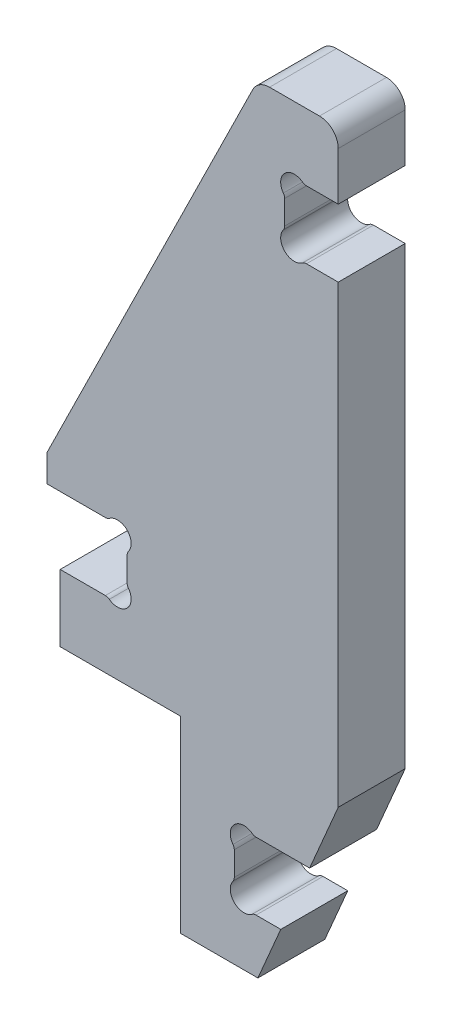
ISO-10303-21;
HEADER;
FILE_DESCRIPTION(('STEP AP214'),'2;1');
FILE_NAME('part.step','',(''),(''),'','','');
FILE_SCHEMA(('AUTOMOTIVE_DESIGN { 1 0 10303 214 1 1 1 1 }'));
ENDSEC;
DATA;
#1=APPLICATION_CONTEXT('core data for automotive mechanical design processes');
#2=APPLICATION_PROTOCOL_DEFINITION('international standard','automotive_design',2000,#1);
#3=PRODUCT_CONTEXT('',#1,'mechanical');
#4=PRODUCT('Part','Part','',(#3));
#5=PRODUCT_RELATED_PRODUCT_CATEGORY('part','',(#4));
#6=PRODUCT_DEFINITION_FORMATION('','',#4);
#7=PRODUCT_DEFINITION_CONTEXT('part definition',#1,'design');
#8=PRODUCT_DEFINITION('design','',#6,#7);
#9=PRODUCT_DEFINITION_SHAPE('','',#8);
#10=(LENGTH_UNIT() NAMED_UNIT(*) SI_UNIT(.MILLI.,.METRE.));
#11=(NAMED_UNIT(*) PLANE_ANGLE_UNIT() SI_UNIT($,.RADIAN.));
#12=(NAMED_UNIT(*) SI_UNIT($,.STERADIAN.) SOLID_ANGLE_UNIT());
#13=UNCERTAINTY_MEASURE_WITH_UNIT(LENGTH_MEASURE(1.E-05),#10,'distance_accuracy_value','');
#14=(GEOMETRIC_REPRESENTATION_CONTEXT(3) GLOBAL_UNCERTAINTY_ASSIGNED_CONTEXT((#13)) GLOBAL_UNIT_ASSIGNED_CONTEXT((#10,
#11,#12)) REPRESENTATION_CONTEXT('',''));
#15=CARTESIAN_POINT('',(0.,0.,0.));
#16=DIRECTION('',(0.,0.,1.));
#17=DIRECTION('',(1.,0.,0.));
#18=AXIS2_PLACEMENT_3D('',#15,#16,#17);
#19=CARTESIAN_POINT('',(46.9458414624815,267.7,25.));
#20=DIRECTION('',(0.,0.,-1.));
#21=DIRECTION('',(-1.,0.,0.));
#22=AXIS2_PLACEMENT_3D('',#19,#20,#21);
#23=CYLINDRICAL_SURFACE('',#22,2.50000000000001);
#24=CARTESIAN_POINT('',(46.9458414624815,267.7,0.));
#25=DIRECTION('',(0.,0.,1.));
#26=DIRECTION('',(1.,0.,0.));
#27=AXIS2_PLACEMENT_3D('',#24,#25,#26);
#28=CIRCLE('',#27,2.50000000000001);
#29=CARTESIAN_POINT('',(45.4574217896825,265.691366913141,0.));
#30=VERTEX_POINT('',#29);
#31=CARTESIAN_POINT('',(46.9458414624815,265.2,0.));
#32=VERTEX_POINT('',#31);
#33=EDGE_CURVE('E314',#30,#32,#28,.T.);
#34=ORIENTED_EDGE('',*,*,#33,.T.);
#35=DIRECTION('',(0.,0.,-1.));
#36=VECTOR('',#35,1.);
#37=CARTESIAN_POINT('',(46.9458414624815,265.2,25.));
#38=LINE('',#37,#36);
#39=CARTESIAN_POINT('',(46.9458414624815,265.2,25.));
#40=VERTEX_POINT('',#39);
#41=EDGE_CURVE('E297',#40,#32,#38,.T.);
#42=ORIENTED_EDGE('',*,*,#41,.F.);
#43=CARTESIAN_POINT('',(46.9458414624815,267.7,25.));
#44=DIRECTION('',(0.,0.,1.));
#45=DIRECTION('',(1.,0.,0.));
#46=AXIS2_PLACEMENT_3D('',#43,#44,#45);
#47=CIRCLE('',#46,2.50000000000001);
#48=CARTESIAN_POINT('',(45.4574217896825,265.691366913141,25.));
#49=VERTEX_POINT('',#48);
#50=EDGE_CURVE('E302',#49,#40,#47,.T.);
#51=ORIENTED_EDGE('',*,*,#50,.F.);
#52=DIRECTION('',(0.,0.,-1.));
#53=VECTOR('',#52,1.);
#54=CARTESIAN_POINT('',(45.4574217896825,265.691366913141,25.));
#55=LINE('',#54,#53);
#56=EDGE_CURVE('E422',#49,#30,#55,.T.);
#57=ORIENTED_EDGE('',*,*,#56,.T.);
#58=EDGE_LOOP('',(#34,#42,#51,#57));
#59=FACE_BOUND('',#58,.T.);
#60=ADVANCED_FACE('F33',(#59),#23,.T.);
#61=CARTESIAN_POINT('',(58.8148010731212,265.2,25.));
#62=DIRECTION('',(0.,1.,0.));
#63=DIRECTION('',(0.,0.,1.));
#64=AXIS2_PLACEMENT_3D('',#61,#62,#63);
#65=PLANE('',#64);
#66=DIRECTION('',(1.,0.,0.));
#67=VECTOR('',#66,1.);
#68=CARTESIAN_POINT('',(58.8148010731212,265.2,0.));
#69=LINE('',#68,#67);
#70=CARTESIAN_POINT('',(58.8148010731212,265.2,0.));
#71=VERTEX_POINT('',#70);
#72=EDGE_CURVE('E349',#32,#71,#69,.T.);
#73=ORIENTED_EDGE('',*,*,#72,.T.);
#74=DIRECTION('',(0.,0.,-1.));
#75=VECTOR('',#74,1.);
#76=CARTESIAN_POINT('',(58.8148010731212,265.2,25.));
#77=LINE('',#76,#75);
#78=CARTESIAN_POINT('',(58.8148010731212,265.2,25.));
#79=VERTEX_POINT('',#78);
#80=EDGE_CURVE('E300',#79,#71,#77,.T.);
#81=ORIENTED_EDGE('',*,*,#80,.F.);
#82=DIRECTION('',(1.,0.,0.));
#83=VECTOR('',#82,1.);
#84=CARTESIAN_POINT('',(58.8148010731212,265.2,25.));
#85=LINE('',#84,#83);
#86=EDGE_CURVE('E293',#40,#79,#85,.T.);
#87=ORIENTED_EDGE('',*,*,#86,.F.);
#88=ORIENTED_EDGE('',*,*,#41,.T.);
#89=EDGE_LOOP('',(#73,#81,#87,#88));
#90=FACE_BOUND('',#89,.T.);
#91=ADVANCED_FACE('F295',(#90),#65,.F.);
#92=CARTESIAN_POINT('',(58.8148010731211,290.2,25.));
#93=DIRECTION('',(-1.,0.,0.));
#94=DIRECTION('',(0.,-1.,0.));
#95=AXIS2_PLACEMENT_3D('',#92,#93,#94);
#96=PLANE('',#95);
#97=DIRECTION('',(0.,1.,0.));
#98=VECTOR('',#97,1.);
#99=CARTESIAN_POINT('',(58.8148010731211,290.2,0.));
#100=LINE('',#99,#98);
#101=CARTESIAN_POINT('',(58.8148010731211,283.2,0.));
#102=VERTEX_POINT('',#101);
#103=EDGE_CURVE('E346',#71,#102,#100,.T.);
#104=ORIENTED_EDGE('',*,*,#103,.T.);
#105=DIRECTION('',(0.,0.,-1.));
#106=VECTOR('',#105,1.);
#107=CARTESIAN_POINT('',(58.8148010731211,283.2,25.));
#108=LINE('',#107,#106);
#109=CARTESIAN_POINT('',(58.8148010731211,283.2,25.));
#110=VERTEX_POINT('',#109);
#111=EDGE_CURVE('E56',#102,#110,#108,.F.);
#112=ORIENTED_EDGE('',*,*,#111,.T.);
#113=DIRECTION('',(0.,1.,0.));
#114=VECTOR('',#113,1.);
#115=CARTESIAN_POINT('',(58.8148010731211,290.2,25.));
#116=LINE('',#115,#114);
#117=EDGE_CURVE('E301',#79,#110,#116,.T.);
#118=ORIENTED_EDGE('',*,*,#117,.F.);
#119=ORIENTED_EDGE('',*,*,#80,.T.);
#120=EDGE_LOOP('',(#104,#112,#118,#119));
#121=FACE_BOUND('',#120,.T.);
#122=ADVANCED_FACE('F348',(#121),#96,.F.);
#123=CARTESIAN_POINT('',(28.8148010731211,290.2,25.));
#124=DIRECTION('',(0.,-1.,0.));
#125=DIRECTION('',(1.,0.,0.));
#126=AXIS2_PLACEMENT_3D('',#123,#124,#125);
#127=PLANE('',#126);
#128=DIRECTION('',(-1.,0.,0.));
#129=VECTOR('',#128,1.);
#130=CARTESIAN_POINT('',(28.8148010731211,290.2,25.));
#131=LINE('',#130,#129);
#132=CARTESIAN_POINT('',(51.8148010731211,290.2,25.));
#133=VERTEX_POINT('',#132);
#134=CARTESIAN_POINT('',(33.1674325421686,290.2,25.));
#135=VERTEX_POINT('',#134);
#136=EDGE_CURVE('E332',#133,#135,#131,.T.);
#137=ORIENTED_EDGE('',*,*,#136,.F.);
#138=DIRECTION('',(0.,0.,-1.));
#139=VECTOR('',#138,1.);
#140=CARTESIAN_POINT('',(51.8148010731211,290.2,25.));
#141=LINE('',#140,#139);
#142=CARTESIAN_POINT('',(51.8148010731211,290.2,0.));
#143=VERTEX_POINT('',#142);
#144=EDGE_CURVE('E317',#133,#143,#141,.T.);
#145=ORIENTED_EDGE('',*,*,#144,.T.);
#146=DIRECTION('',(-1.,0.,0.));
#147=VECTOR('',#146,1.);
#148=CARTESIAN_POINT('',(28.8148010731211,290.2,0.));
#149=LINE('',#148,#147);
#150=CARTESIAN_POINT('',(33.1674325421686,290.2,0.));
#151=VERTEX_POINT('',#150);
#152=EDGE_CURVE('E347',#143,#151,#149,.T.);
#153=ORIENTED_EDGE('',*,*,#152,.T.);
#154=DIRECTION('',(0.,0.,-1.));
#155=VECTOR('',#154,1.);
#156=CARTESIAN_POINT('',(33.1674325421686,290.2,25.));
#157=LINE('',#156,#155);
#158=EDGE_CURVE('E315',#151,#135,#157,.F.);
#159=ORIENTED_EDGE('',*,*,#158,.T.);
#160=EDGE_LOOP('',(#137,#145,#153,#159));
#161=FACE_BOUND('',#160,.T.);
#162=ADVANCED_FACE('F336',(#161),#127,.F.);
#163=CARTESIAN_POINT('',(-50.,130.4,25.));
#164=DIRECTION('',(0.896850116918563,-0.442334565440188,0.));
#165=DIRECTION('',(0.442334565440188,0.896850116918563,0.));
#166=AXIS2_PLACEMENT_3D('',#163,#164,#165);
#167=PLANE('',#166);
#168=DIRECTION('',(-0.442334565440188,-0.896850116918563,0.));
#169=VECTOR('',#168,1.);
#170=CARTESIAN_POINT('',(-50.,130.4,25.));
#171=LINE('',#170,#169);
#172=CARTESIAN_POINT('',(26.8894817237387,286.296341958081,25.));
#173=VERTEX_POINT('',#172);
#174=CARTESIAN_POINT('',(-50.,130.4,25.));
#175=VERTEX_POINT('',#174);
#176=EDGE_CURVE('E340',#173,#175,#171,.T.);
#177=ORIENTED_EDGE('',*,*,#176,.F.);
#178=DIRECTION('',(0.,0.,-1.));
#179=VECTOR('',#178,1.);
#180=CARTESIAN_POINT('',(26.8894817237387,286.296341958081,25.));
#181=LINE('',#180,#179);
#182=CARTESIAN_POINT('',(26.8894817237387,286.296341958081,0.));
#183=VERTEX_POINT('',#182);
#184=EDGE_CURVE('E11',#173,#183,#181,.T.);
#185=ORIENTED_EDGE('',*,*,#184,.T.);
#186=DIRECTION('',(-0.442334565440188,-0.896850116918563,0.));
#187=VECTOR('',#186,1.);
#188=CARTESIAN_POINT('',(-50.,130.4,0.));
#189=LINE('',#188,#187);
#190=CARTESIAN_POINT('',(-50.,130.4,0.));
#191=VERTEX_POINT('',#190);
#192=EDGE_CURVE('E351',#183,#191,#189,.T.);
#193=ORIENTED_EDGE('',*,*,#192,.T.);
#194=DIRECTION('',(0.,0.,-1.));
#195=VECTOR('',#194,1.);
#196=CARTESIAN_POINT('',(-50.,130.4,25.));
#197=LINE('',#196,#195);
#198=EDGE_CURVE('E319',#175,#191,#197,.T.);
#199=ORIENTED_EDGE('',*,*,#198,.F.);
#200=EDGE_LOOP('',(#177,#185,#193,#199));
#201=FACE_BOUND('',#200,.T.);
#202=ADVANCED_FACE('F956',(#201),#167,.F.);
#203=CARTESIAN_POINT('',(-50.,120.4,25.));
#204=DIRECTION('',(1.,0.,0.));
#205=DIRECTION('',(0.,1.,0.));
#206=AXIS2_PLACEMENT_3D('',#203,#204,#205);
#207=PLANE('',#206);
#208=DIRECTION('',(0.,-1.,0.));
#209=VECTOR('',#208,1.);
#210=CARTESIAN_POINT('',(-50.,120.4,0.));
#211=LINE('',#210,#209);
#212=CARTESIAN_POINT('',(-50.,120.4,0.));
#213=VERTEX_POINT('',#212);
#214=EDGE_CURVE('E357',#191,#213,#211,.T.);
#215=ORIENTED_EDGE('',*,*,#214,.T.);
#216=DIRECTION('',(0.,0.,-1.));
#217=VECTOR('',#216,1.);
#218=CARTESIAN_POINT('',(-50.,120.4,25.));
#219=LINE('',#218,#217);
#220=CARTESIAN_POINT('',(-50.,120.4,25.));
#221=VERTEX_POINT('',#220);
#222=EDGE_CURVE('E517',#221,#213,#219,.T.);
#223=ORIENTED_EDGE('',*,*,#222,.F.);
#224=DIRECTION('',(0.,-1.,0.));
#225=VECTOR('',#224,1.);
#226=CARTESIAN_POINT('',(-50.,120.4,25.));
#227=LINE('',#226,#225);
#228=EDGE_CURVE('E526',#175,#221,#227,.T.);
#229=ORIENTED_EDGE('',*,*,#228,.F.);
#230=ORIENTED_EDGE('',*,*,#198,.T.);
#231=EDGE_LOOP('',(#215,#223,#229,#230));
#232=FACE_BOUND('',#231,.T.);
#233=ADVANCED_FACE('F524',(#232),#207,.F.);
#234=CARTESIAN_POINT('',(-50.,120.4,25.));
#235=DIRECTION('',(0.,1.,0.));
#236=DIRECTION('',(-1.,0.,0.));
#237=AXIS2_PLACEMENT_3D('',#234,#235,#236);
#238=PLANE('',#237);
#239=DIRECTION('',(1.,0.,0.));
#240=VECTOR('',#239,1.);
#241=CARTESIAN_POINT('',(-50.,120.4,0.));
#242=LINE('',#241,#240);
#243=CARTESIAN_POINT('',(-28.1310403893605,120.4,0.));
#244=VERTEX_POINT('',#243);
#245=EDGE_CURVE('E359',#213,#244,#242,.T.);
#246=ORIENTED_EDGE('',*,*,#245,.T.);
#247=DIRECTION('',(0.,0.,-1.));
#248=VECTOR('',#247,1.);
#249=CARTESIAN_POINT('',(-28.1310403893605,120.4,25.));
#250=LINE('',#249,#248);
#251=CARTESIAN_POINT('',(-28.1310403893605,120.4,25.));
#252=VERTEX_POINT('',#251);
#253=EDGE_CURVE('E514',#252,#244,#250,.T.);
#254=ORIENTED_EDGE('',*,*,#253,.F.);
#255=DIRECTION('',(1.,0.,0.));
#256=VECTOR('',#255,1.);
#257=CARTESIAN_POINT('',(-50.,120.4,25.));
#258=LINE('',#257,#256);
#259=EDGE_CURVE('E543',#221,#252,#258,.T.);
#260=ORIENTED_EDGE('',*,*,#259,.F.);
#261=ORIENTED_EDGE('',*,*,#222,.T.);
#262=EDGE_LOOP('',(#246,#254,#260,#261));
#263=FACE_BOUND('',#262,.T.);
#264=ADVANCED_FACE('F534',(#263),#238,.F.);
#265=CARTESIAN_POINT('',(-28.1310403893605,122.9,25.));
#266=DIRECTION('',(0.,0.,-1.));
#267=DIRECTION('',(-1.,0.,0.));
#268=AXIS2_PLACEMENT_3D('',#265,#266,#267);
#269=CYLINDRICAL_SURFACE('',#268,2.50000000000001);
#270=CARTESIAN_POINT('',(-28.1310403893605,122.9,0.));
#271=DIRECTION('',(0.,0.,1.));
#272=DIRECTION('',(-1.,0.,0.));
#273=AXIS2_PLACEMENT_3D('',#270,#271,#272);
#274=CIRCLE('',#273,2.50000000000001);
#275=CARTESIAN_POINT('',(-26.6426207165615,120.891366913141,0.));
#276=VERTEX_POINT('',#275);
#277=EDGE_CURVE('E361',#244,#276,#274,.T.);
#278=ORIENTED_EDGE('',*,*,#277,.T.);
#279=DIRECTION('',(0.,0.,-1.));
#280=VECTOR('',#279,1.);
#281=CARTESIAN_POINT('',(-26.6426207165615,120.891366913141,25.));
#282=LINE('',#281,#280);
#283=CARTESIAN_POINT('',(-26.6426207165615,120.891366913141,25.));
#284=VERTEX_POINT('',#283);
#285=EDGE_CURVE('E511',#284,#276,#282,.T.);
#286=ORIENTED_EDGE('',*,*,#285,.F.);
#287=CARTESIAN_POINT('',(-28.1310403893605,122.9,25.));
#288=DIRECTION('',(0.,0.,1.));
#289=DIRECTION('',(-1.,0.,0.));
#290=AXIS2_PLACEMENT_3D('',#287,#288,#289);
#291=CIRCLE('',#290,2.50000000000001);
#292=EDGE_CURVE('E540',#252,#284,#291,.T.);
#293=ORIENTED_EDGE('',*,*,#292,.F.);
#294=ORIENTED_EDGE('',*,*,#253,.T.);
#295=EDGE_LOOP('',(#278,#286,#293,#294));
#296=FACE_BOUND('',#295,.T.);
#297=ADVANCED_FACE('F538',(#296),#269,.T.);
#298=CARTESIAN_POINT('',(-23.6062445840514,116.793755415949,25.));
#299=DIRECTION('',(0.,0.,-1.));
#300=DIRECTION('',(-1.,0.,0.));
#301=AXIS2_PLACEMENT_3D('',#298,#299,#300);
#302=CYLINDRICAL_SURFACE('',#301,5.1);
#303=CARTESIAN_POINT('',(-23.6062445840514,116.793755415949,0.));
#304=DIRECTION('',(0.,0.,-1.));
#305=DIRECTION('',(-1.,0.,0.));
#306=AXIS2_PLACEMENT_3D('',#303,#304,#305);
#307=CIRCLE('',#306,5.1);
#308=CARTESIAN_POINT('',(-19.508633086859,113.757379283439,0.));
#309=VERTEX_POINT('',#308);
#310=EDGE_CURVE('E363',#276,#309,#307,.T.);
#311=ORIENTED_EDGE('',*,*,#310,.T.);
#312=DIRECTION('',(0.,0.,-1.));
#313=VECTOR('',#312,1.);
#314=CARTESIAN_POINT('',(-19.508633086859,113.757379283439,25.));
#315=LINE('',#314,#313);
#316=CARTESIAN_POINT('',(-19.508633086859,113.757379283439,25.));
#317=VERTEX_POINT('',#316);
#318=EDGE_CURVE('E508',#317,#309,#315,.T.);
#319=ORIENTED_EDGE('',*,*,#318,.F.);
#320=CARTESIAN_POINT('',(-23.6062445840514,116.793755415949,25.));
#321=DIRECTION('',(0.,0.,-1.));
#322=DIRECTION('',(-1.,0.,0.));
#323=AXIS2_PLACEMENT_3D('',#320,#321,#322);
#324=CIRCLE('',#323,5.1);
#325=EDGE_CURVE('E542',#284,#317,#324,.T.);
#326=ORIENTED_EDGE('',*,*,#325,.F.);
#327=ORIENTED_EDGE('',*,*,#285,.T.);
#328=EDGE_LOOP('',(#311,#319,#326,#327));
#329=FACE_BOUND('',#328,.T.);
#330=ADVANCED_FACE('F750',(#329),#302,.F.);
#331=CARTESIAN_POINT('',(-17.5,112.268959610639,25.));
#332=DIRECTION('',(0.,0.,-1.));
#333=DIRECTION('',(-1.,0.,0.));
#334=AXIS2_PLACEMENT_3D('',#331,#332,#333);
#335=CYLINDRICAL_SURFACE('',#334,2.5);
#336=CARTESIAN_POINT('',(-17.5,112.268959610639,0.));
#337=DIRECTION('',(0.,0.,1.));
#338=DIRECTION('',(1.,0.,0.));
#339=AXIS2_PLACEMENT_3D('',#336,#337,#338);
#340=CIRCLE('',#339,2.5);
#341=CARTESIAN_POINT('',(-20.,112.268959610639,0.));
#342=VERTEX_POINT('',#341);
#343=EDGE_CURVE('E365',#309,#342,#340,.T.);
#344=ORIENTED_EDGE('',*,*,#343,.T.);
#345=DIRECTION('',(0.,0.,-1.));
#346=VECTOR('',#345,1.);
#347=CARTESIAN_POINT('',(-20.,112.268959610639,25.));
#348=LINE('',#347,#346);
#349=CARTESIAN_POINT('',(-20.,112.268959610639,25.));
#350=VERTEX_POINT('',#349);
#351=EDGE_CURVE('E505',#350,#342,#348,.T.);
#352=ORIENTED_EDGE('',*,*,#351,.F.);
#353=CARTESIAN_POINT('',(-17.5,112.268959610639,25.));
#354=DIRECTION('',(0.,0.,1.));
#355=DIRECTION('',(1.,0.,0.));
#356=AXIS2_PLACEMENT_3D('',#353,#354,#355);
#357=CIRCLE('',#356,2.5);
#358=EDGE_CURVE('E545',#317,#350,#357,.T.);
#359=ORIENTED_EDGE('',*,*,#358,.F.);
#360=ORIENTED_EDGE('',*,*,#318,.T.);
#361=EDGE_LOOP('',(#344,#352,#359,#360));
#362=FACE_BOUND('',#361,.T.);
#363=ADVANCED_FACE('F747',(#362),#335,.T.);
#364=CARTESIAN_POINT('',(-20.,103.331040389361,25.));
#365=DIRECTION('',(1.,0.,0.));
#366=DIRECTION('',(0.,0.,-1.));
#367=AXIS2_PLACEMENT_3D('',#364,#365,#366);
#368=PLANE('',#367);
#369=DIRECTION('',(0.,-1.,0.));
#370=VECTOR('',#369,1.);
#371=CARTESIAN_POINT('',(-20.,103.331040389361,0.));
#372=LINE('',#371,#370);
#373=CARTESIAN_POINT('',(-20.,103.331040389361,0.));
#374=VERTEX_POINT('',#373);
#375=EDGE_CURVE('E367',#342,#374,#372,.T.);
#376=ORIENTED_EDGE('',*,*,#375,.T.);
#377=DIRECTION('',(0.,0.,-1.));
#378=VECTOR('',#377,1.);
#379=CARTESIAN_POINT('',(-20.,103.331040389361,25.));
#380=LINE('',#379,#378);
#381=CARTESIAN_POINT('',(-20.,103.331040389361,25.));
#382=VERTEX_POINT('',#381);
#383=EDGE_CURVE('E502',#382,#374,#380,.T.);
#384=ORIENTED_EDGE('',*,*,#383,.F.);
#385=DIRECTION('',(0.,-1.,0.));
#386=VECTOR('',#385,1.);
#387=CARTESIAN_POINT('',(-20.,103.331040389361,25.));
#388=LINE('',#387,#386);
#389=EDGE_CURVE('E551',#350,#382,#388,.T.);
#390=ORIENTED_EDGE('',*,*,#389,.F.);
#391=ORIENTED_EDGE('',*,*,#351,.T.);
#392=EDGE_LOOP('',(#376,#384,#390,#391));
#393=FACE_BOUND('',#392,.T.);
#394=ADVANCED_FACE('F743',(#393),#368,.F.);
#395=CARTESIAN_POINT('',(-17.5,103.331040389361,25.));
#396=DIRECTION('',(0.,0.,-1.));
#397=DIRECTION('',(-1.,0.,0.));
#398=AXIS2_PLACEMENT_3D('',#395,#396,#397);
#399=CYLINDRICAL_SURFACE('',#398,2.5);
#400=CARTESIAN_POINT('',(-17.5,103.331040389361,0.));
#401=DIRECTION('',(0.,0.,1.));
#402=DIRECTION('',(-1.,0.,0.));
#403=AXIS2_PLACEMENT_3D('',#400,#401,#402);
#404=CIRCLE('',#403,2.5);
#405=CARTESIAN_POINT('',(-19.508633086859,101.842620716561,0.));
#406=VERTEX_POINT('',#405);
#407=EDGE_CURVE('E369',#374,#406,#404,.T.);
#408=ORIENTED_EDGE('',*,*,#407,.T.);
#409=DIRECTION('',(0.,0.,-1.));
#410=VECTOR('',#409,1.);
#411=CARTESIAN_POINT('',(-19.508633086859,101.842620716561,25.));
#412=LINE('',#411,#410);
#413=CARTESIAN_POINT('',(-19.508633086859,101.842620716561,25.));
#414=VERTEX_POINT('',#413);
#415=EDGE_CURVE('E499',#414,#406,#412,.T.);
#416=ORIENTED_EDGE('',*,*,#415,.F.);
#417=CARTESIAN_POINT('',(-17.5,103.331040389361,25.));
#418=DIRECTION('',(0.,0.,1.));
#419=DIRECTION('',(-1.,0.,0.));
#420=AXIS2_PLACEMENT_3D('',#417,#418,#419);
#421=CIRCLE('',#420,2.5);
#422=EDGE_CURVE('E553',#382,#414,#421,.T.);
#423=ORIENTED_EDGE('',*,*,#422,.F.);
#424=ORIENTED_EDGE('',*,*,#383,.T.);
#425=EDGE_LOOP('',(#408,#416,#423,#424));
#426=FACE_BOUND('',#425,.T.);
#427=ADVANCED_FACE('F738',(#426),#399,.T.);
#428=CARTESIAN_POINT('',(-23.6062445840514,98.8062445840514,25.));
#429=DIRECTION('',(0.,0.,-1.));
#430=DIRECTION('',(-1.,0.,0.));
#431=AXIS2_PLACEMENT_3D('',#428,#429,#430);
#432=CYLINDRICAL_SURFACE('',#431,5.1);
#433=CARTESIAN_POINT('',(-23.6062445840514,98.8062445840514,0.));
#434=DIRECTION('',(0.,0.,-1.));
#435=DIRECTION('',(1.,0.,0.));
#436=AXIS2_PLACEMENT_3D('',#433,#434,#435);
#437=CIRCLE('',#436,5.1);
#438=CARTESIAN_POINT('',(-26.6426207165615,94.708633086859,0.));
#439=VERTEX_POINT('',#438);
#440=EDGE_CURVE('E371',#406,#439,#437,.T.);
#441=ORIENTED_EDGE('',*,*,#440,.T.);
#442=DIRECTION('',(0.,0.,-1.));
#443=VECTOR('',#442,1.);
#444=CARTESIAN_POINT('',(-26.6426207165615,94.708633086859,25.));
#445=LINE('',#444,#443);
#446=CARTESIAN_POINT('',(-26.6426207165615,94.708633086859,25.));
#447=VERTEX_POINT('',#446);
#448=EDGE_CURVE('E496',#447,#439,#445,.T.);
#449=ORIENTED_EDGE('',*,*,#448,.F.);
#450=CARTESIAN_POINT('',(-23.6062445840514,98.8062445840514,25.));
#451=DIRECTION('',(0.,0.,-1.));
#452=DIRECTION('',(1.,0.,0.));
#453=AXIS2_PLACEMENT_3D('',#450,#451,#452);
#454=CIRCLE('',#453,5.1);
#455=EDGE_CURVE('E555',#414,#447,#454,.T.);
#456=ORIENTED_EDGE('',*,*,#455,.F.);
#457=ORIENTED_EDGE('',*,*,#415,.T.);
#458=EDGE_LOOP('',(#441,#449,#456,#457));
#459=FACE_BOUND('',#458,.T.);
#460=ADVANCED_FACE('F732',(#459),#432,.F.);
#461=CARTESIAN_POINT('',(-28.1310403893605,92.7,25.));
#462=DIRECTION('',(0.,0.,-1.));
#463=DIRECTION('',(-1.,0.,0.));
#464=AXIS2_PLACEMENT_3D('',#461,#462,#463);
#465=CYLINDRICAL_SURFACE('',#464,2.50000000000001);
#466=CARTESIAN_POINT('',(-28.1310403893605,92.7,0.));
#467=DIRECTION('',(0.,0.,1.));
#468=DIRECTION('',(1.,0.,0.));
#469=AXIS2_PLACEMENT_3D('',#466,#467,#468);
#470=CIRCLE('',#469,2.50000000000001);
#471=CARTESIAN_POINT('',(-28.1310403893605,95.2,0.));
#472=VERTEX_POINT('',#471);
#473=EDGE_CURVE('E373',#439,#472,#470,.T.);
#474=ORIENTED_EDGE('',*,*,#473,.T.);
#475=DIRECTION('',(0.,0.,-1.));
#476=VECTOR('',#475,1.);
#477=CARTESIAN_POINT('',(-28.1310403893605,95.2,25.));
#478=LINE('',#477,#476);
#479=CARTESIAN_POINT('',(-28.1310403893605,95.2,25.));
#480=VERTEX_POINT('',#479);
#481=EDGE_CURVE('E493',#480,#472,#478,.T.);
#482=ORIENTED_EDGE('',*,*,#481,.F.);
#483=CARTESIAN_POINT('',(-28.1310403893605,92.7,25.));
#484=DIRECTION('',(0.,0.,1.));
#485=DIRECTION('',(1.,0.,0.));
#486=AXIS2_PLACEMENT_3D('',#483,#484,#485);
#487=CIRCLE('',#486,2.50000000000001);
#488=EDGE_CURVE('E557',#447,#480,#487,.T.);
#489=ORIENTED_EDGE('',*,*,#488,.F.);
#490=ORIENTED_EDGE('',*,*,#448,.T.);
#491=EDGE_LOOP('',(#474,#482,#489,#490));
#492=FACE_BOUND('',#491,.T.);
#493=ADVANCED_FACE('F728',(#492),#465,.T.);
#494=CARTESIAN_POINT('',(-45.,95.2,25.));
#495=DIRECTION('',(0.,-1.,0.));
#496=DIRECTION('',(1.,0.,0.));
#497=AXIS2_PLACEMENT_3D('',#494,#495,#496);
#498=PLANE('',#497);
#499=DIRECTION('',(-1.,0.,0.));
#500=VECTOR('',#499,1.);
#501=CARTESIAN_POINT('',(-45.,95.2,0.));
#502=LINE('',#501,#500);
#503=CARTESIAN_POINT('',(-45.,95.2,0.));
#504=VERTEX_POINT('',#503);
#505=EDGE_CURVE('E375',#472,#504,#502,.T.);
#506=ORIENTED_EDGE('',*,*,#505,.T.);
#507=DIRECTION('',(0.,0.,-1.));
#508=VECTOR('',#507,1.);
#509=CARTESIAN_POINT('',(-45.,95.2,25.));
#510=LINE('',#509,#508);
#511=CARTESIAN_POINT('',(-45.,95.2,25.));
#512=VERTEX_POINT('',#511);
#513=EDGE_CURVE('E490',#512,#504,#510,.T.);
#514=ORIENTED_EDGE('',*,*,#513,.F.);
#515=DIRECTION('',(-1.,0.,0.));
#516=VECTOR('',#515,1.);
#517=CARTESIAN_POINT('',(-45.,95.2,25.));
#518=LINE('',#517,#516);
#519=EDGE_CURVE('E559',#480,#512,#518,.T.);
#520=ORIENTED_EDGE('',*,*,#519,.F.);
#521=ORIENTED_EDGE('',*,*,#481,.T.);
#522=EDGE_LOOP('',(#506,#514,#520,#521));
#523=FACE_BOUND('',#522,.T.);
#524=ADVANCED_FACE('F723',(#523),#498,.F.);
#525=CARTESIAN_POINT('',(-45.,95.2,25.));
#526=DIRECTION('',(1.,0.,0.));
#527=DIRECTION('',(0.,0.,-1.));
#528=AXIS2_PLACEMENT_3D('',#525,#526,#527);
#529=PLANE('',#528);
#530=DIRECTION('',(0.,-1.,0.));
#531=VECTOR('',#530,1.);
#532=CARTESIAN_POINT('',(-45.,95.2,0.));
#533=LINE('',#532,#531);
#534=CARTESIAN_POINT('',(-45.,70.2,0.));
#535=VERTEX_POINT('',#534);
#536=EDGE_CURVE('E377',#504,#535,#533,.T.);
#537=ORIENTED_EDGE('',*,*,#536,.T.);
#538=DIRECTION('',(0.,0.,-1.));
#539=VECTOR('',#538,1.);
#540=CARTESIAN_POINT('',(-45.,70.2,25.));
#541=LINE('',#540,#539);
#542=CARTESIAN_POINT('',(-45.,70.2,25.));
#543=VERTEX_POINT('',#542);
#544=EDGE_CURVE('E487',#543,#535,#541,.T.);
#545=ORIENTED_EDGE('',*,*,#544,.F.);
#546=DIRECTION('',(0.,-1.,0.));
#547=VECTOR('',#546,1.);
#548=CARTESIAN_POINT('',(-45.,95.2,25.));
#549=LINE('',#548,#547);
#550=EDGE_CURVE('E561',#512,#543,#549,.T.);
#551=ORIENTED_EDGE('',*,*,#550,.F.);
#552=ORIENTED_EDGE('',*,*,#513,.T.);
#553=EDGE_LOOP('',(#537,#545,#551,#552));
#554=FACE_BOUND('',#553,.T.);
#555=ADVANCED_FACE('F717',(#554),#529,.F.);
#556=CARTESIAN_POINT('',(-45.,70.2,25.));
#557=DIRECTION('',(0.,1.,0.));
#558=DIRECTION('',(-1.,0.,0.));
#559=AXIS2_PLACEMENT_3D('',#556,#557,#558);
#560=PLANE('',#559);
#561=DIRECTION('',(1.,0.,0.));
#562=VECTOR('',#561,1.);
#563=CARTESIAN_POINT('',(-45.,70.2,0.));
#564=LINE('',#563,#562);
#565=CARTESIAN_POINT('',(0.,70.2,0.));
#566=VERTEX_POINT('',#565);
#567=EDGE_CURVE('E379',#535,#566,#564,.T.);
#568=ORIENTED_EDGE('',*,*,#567,.T.);
#569=DIRECTION('',(0.,0.,-1.));
#570=VECTOR('',#569,1.);
#571=CARTESIAN_POINT('',(0.,70.2,25.));
#572=LINE('',#571,#570);
#573=CARTESIAN_POINT('',(0.,70.2,25.));
#574=VERTEX_POINT('',#573);
#575=EDGE_CURVE('E484',#574,#566,#572,.T.);
#576=ORIENTED_EDGE('',*,*,#575,.F.);
#577=DIRECTION('',(1.,0.,0.));
#578=VECTOR('',#577,1.);
#579=CARTESIAN_POINT('',(-45.,70.2,25.));
#580=LINE('',#579,#578);
#581=EDGE_CURVE('E563',#543,#574,#580,.T.);
#582=ORIENTED_EDGE('',*,*,#581,.F.);
#583=ORIENTED_EDGE('',*,*,#544,.T.);
#584=EDGE_LOOP('',(#568,#576,#582,#583));
#585=FACE_BOUND('',#584,.T.);
#586=ADVANCED_FACE('F713',(#585),#560,.F.);
#587=CARTESIAN_POINT('',(0.,70.2,25.));
#588=DIRECTION('',(1.,0.,0.));
#589=DIRECTION('',(0.,1.,0.));
#590=AXIS2_PLACEMENT_3D('',#587,#588,#589);
#591=PLANE('',#590);
#592=DIRECTION('',(0.,-1.,0.));
#593=VECTOR('',#592,1.);
#594=CARTESIAN_POINT('',(0.,70.2,0.));
#595=LINE('',#594,#593);
#596=CARTESIAN_POINT('',(0.,0.,0.));
#597=VERTEX_POINT('',#596);
#598=EDGE_CURVE('E381',#566,#597,#595,.T.);
#599=ORIENTED_EDGE('',*,*,#598,.T.);
#600=DIRECTION('',(0.,0.,-1.));
#601=VECTOR('',#600,1.);
#602=CARTESIAN_POINT('',(0.,0.,25.));
#603=LINE('',#602,#601);
#604=CARTESIAN_POINT('',(0.,0.,25.));
#605=VERTEX_POINT('',#604);
#606=EDGE_CURVE('E481',#605,#597,#603,.T.);
#607=ORIENTED_EDGE('',*,*,#606,.F.);
#608=DIRECTION('',(0.,-1.,0.));
#609=VECTOR('',#608,1.);
#610=CARTESIAN_POINT('',(0.,70.2,25.));
#611=LINE('',#610,#609);
#612=EDGE_CURVE('E565',#574,#605,#611,.T.);
#613=ORIENTED_EDGE('',*,*,#612,.F.);
#614=ORIENTED_EDGE('',*,*,#575,.T.);
#615=EDGE_LOOP('',(#599,#607,#613,#614));
#616=FACE_BOUND('',#615,.T.);
#617=ADVANCED_FACE('F708',(#616),#591,.F.);
#618=CARTESIAN_POINT('',(0.,0.,25.));
#619=DIRECTION('',(0.,1.,0.));
#620=DIRECTION('',(-1.,0.,0.));
#621=AXIS2_PLACEMENT_3D('',#618,#619,#620);
#622=PLANE('',#621);
#623=DIRECTION('',(1.,0.,0.));
#624=VECTOR('',#623,1.);
#625=CARTESIAN_POINT('',(0.,0.,0.));
#626=LINE('',#625,#624);
#627=CARTESIAN_POINT('',(28.8148010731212,0.,0.));
#628=VERTEX_POINT('',#627);
#629=EDGE_CURVE('E383',#597,#628,#626,.T.);
#630=ORIENTED_EDGE('',*,*,#629,.T.);
#631=DIRECTION('',(0.,0.,-1.));
#632=VECTOR('',#631,1.);
#633=CARTESIAN_POINT('',(28.8148010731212,0.,25.));
#634=LINE('',#633,#632);
#635=CARTESIAN_POINT('',(28.8148010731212,0.,25.));
#636=VERTEX_POINT('',#635);
#637=EDGE_CURVE('E478',#636,#628,#634,.T.);
#638=ORIENTED_EDGE('',*,*,#637,.F.);
#639=DIRECTION('',(1.,0.,0.));
#640=VECTOR('',#639,1.);
#641=CARTESIAN_POINT('',(0.,0.,25.));
#642=LINE('',#641,#640);
#643=EDGE_CURVE('E567',#605,#636,#642,.T.);
#644=ORIENTED_EDGE('',*,*,#643,.F.);
#645=ORIENTED_EDGE('',*,*,#606,.T.);
#646=EDGE_LOOP('',(#630,#638,#644,#645));
#647=FACE_BOUND('',#646,.T.);
#648=ADVANCED_FACE('F702',(#647),#622,.F.);
#649=CARTESIAN_POINT('',(28.8148010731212,0.,25.));
#650=DIRECTION('',(-0.91955106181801,0.392970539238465,0.));
#651=DIRECTION('',(-0.392970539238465,-0.91955106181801,0.));
#652=AXIS2_PLACEMENT_3D('',#649,#650,#651);
#653=PLANE('',#652);
#654=DIRECTION('',(0.392970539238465,0.91955106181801,0.));
#655=VECTOR('',#654,1.);
#656=CARTESIAN_POINT('',(28.8148010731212,0.,0.));
#657=LINE('',#656,#655);
#658=CARTESIAN_POINT('',(37.3618096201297,20.,0.));
#659=VERTEX_POINT('',#658);
#660=EDGE_CURVE('E385',#628,#659,#657,.T.);
#661=ORIENTED_EDGE('',*,*,#660,.T.);
#662=DIRECTION('',(0.,0.,-1.));
#663=VECTOR('',#662,1.);
#664=CARTESIAN_POINT('',(37.3618096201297,20.,25.));
#665=LINE('',#664,#663);
#666=CARTESIAN_POINT('',(37.3618096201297,20.,25.));
#667=VERTEX_POINT('',#666);
#668=EDGE_CURVE('E475',#667,#659,#665,.T.);
#669=ORIENTED_EDGE('',*,*,#668,.F.);
#670=DIRECTION('',(0.392970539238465,0.91955106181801,0.));
#671=VECTOR('',#670,1.);
#672=CARTESIAN_POINT('',(28.8148010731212,0.,25.));
#673=LINE('',#672,#671);
#674=EDGE_CURVE('E569',#636,#667,#673,.T.);
#675=ORIENTED_EDGE('',*,*,#674,.F.);
#676=ORIENTED_EDGE('',*,*,#637,.T.);
#677=EDGE_LOOP('',(#661,#669,#675,#676));
#678=FACE_BOUND('',#677,.T.);
#679=ADVANCED_FACE('F698',(#678),#653,.F.);
#680=CARTESIAN_POINT('',(37.3618096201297,20.,25.));
#681=DIRECTION('',(0.,-1.,0.));
#682=DIRECTION('',(1.,0.,0.));
#683=AXIS2_PLACEMENT_3D('',#680,#681,#682);
#684=PLANE('',#683);
#685=DIRECTION('',(-1.,0.,0.));
#686=VECTOR('',#685,1.);
#687=CARTESIAN_POINT('',(37.3618096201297,20.,0.));
#688=LINE('',#687,#686);
#689=CARTESIAN_POINT('',(28.1310403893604,20.,0.));
#690=VERTEX_POINT('',#689);
#691=EDGE_CURVE('E387',#659,#690,#688,.T.);
#692=ORIENTED_EDGE('',*,*,#691,.T.);
#693=DIRECTION('',(0.,0.,-1.));
#694=VECTOR('',#693,1.);
#695=CARTESIAN_POINT('',(28.1310403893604,20.,25.));
#696=LINE('',#695,#694);
#697=CARTESIAN_POINT('',(28.1310403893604,20.,25.));
#698=VERTEX_POINT('',#697);
#699=EDGE_CURVE('E472',#698,#690,#696,.T.);
#700=ORIENTED_EDGE('',*,*,#699,.F.);
#701=DIRECTION('',(-1.,0.,0.));
#702=VECTOR('',#701,1.);
#703=CARTESIAN_POINT('',(37.3618096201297,20.,25.));
#704=LINE('',#703,#702);
#705=EDGE_CURVE('E571',#667,#698,#704,.T.);
#706=ORIENTED_EDGE('',*,*,#705,.F.);
#707=ORIENTED_EDGE('',*,*,#668,.T.);
#708=EDGE_LOOP('',(#692,#700,#706,#707));
#709=FACE_BOUND('',#708,.T.);
#710=ADVANCED_FACE('F693',(#709),#684,.F.);
#711=CARTESIAN_POINT('',(28.1310403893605,17.5,25.));
#712=DIRECTION('',(0.,0.,-1.));
#713=DIRECTION('',(-1.,0.,0.));
#714=AXIS2_PLACEMENT_3D('',#711,#712,#713);
#715=CYLINDRICAL_SURFACE('',#714,2.5);
#716=CARTESIAN_POINT('',(28.1310403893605,17.5,0.));
#717=DIRECTION('',(0.,0.,1.));
#718=DIRECTION('',(-1.,0.,0.));
#719=AXIS2_PLACEMENT_3D('',#716,#717,#718);
#720=CIRCLE('',#719,2.5);
#721=CARTESIAN_POINT('',(26.6426207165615,19.508633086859,0.));
#722=VERTEX_POINT('',#721);
#723=EDGE_CURVE('E389',#690,#722,#720,.T.);
#724=ORIENTED_EDGE('',*,*,#723,.T.);
#725=DIRECTION('',(0.,0.,-1.));
#726=VECTOR('',#725,1.);
#727=CARTESIAN_POINT('',(26.6426207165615,19.508633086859,25.));
#728=LINE('',#727,#726);
#729=CARTESIAN_POINT('',(26.6426207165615,19.508633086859,25.));
#730=VERTEX_POINT('',#729);
#731=EDGE_CURVE('E469',#730,#722,#728,.T.);
#732=ORIENTED_EDGE('',*,*,#731,.F.);
#733=CARTESIAN_POINT('',(28.1310403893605,17.5,25.));
#734=DIRECTION('',(0.,0.,1.));
#735=DIRECTION('',(-1.,0.,0.));
#736=AXIS2_PLACEMENT_3D('',#733,#734,#735);
#737=CIRCLE('',#736,2.5);
#738=EDGE_CURVE('E573',#698,#730,#737,.T.);
#739=ORIENTED_EDGE('',*,*,#738,.F.);
#740=ORIENTED_EDGE('',*,*,#699,.T.);
#741=EDGE_LOOP('',(#724,#732,#739,#740));
#742=FACE_BOUND('',#741,.T.);
#743=ADVANCED_FACE('F687',(#742),#715,.T.);
#744=CARTESIAN_POINT('',(23.6062445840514,23.6062445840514,25.));
#745=DIRECTION('',(0.,0.,-1.));
#746=DIRECTION('',(-1.,0.,0.));
#747=AXIS2_PLACEMENT_3D('',#744,#745,#746);
#748=CYLINDRICAL_SURFACE('',#747,5.1);
#749=CARTESIAN_POINT('',(23.6062445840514,23.6062445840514,0.));
#750=DIRECTION('',(0.,0.,-1.));
#751=DIRECTION('',(-1.,0.,0.));
#752=AXIS2_PLACEMENT_3D('',#749,#750,#751);
#753=CIRCLE('',#752,5.1);
#754=CARTESIAN_POINT('',(19.508633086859,26.6426207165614,0.));
#755=VERTEX_POINT('',#754);
#756=EDGE_CURVE('E391',#722,#755,#753,.T.);
#757=ORIENTED_EDGE('',*,*,#756,.T.);
#758=DIRECTION('',(0.,0.,-1.));
#759=VECTOR('',#758,1.);
#760=CARTESIAN_POINT('',(19.508633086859,26.6426207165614,25.));
#761=LINE('',#760,#759);
#762=CARTESIAN_POINT('',(19.508633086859,26.6426207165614,25.));
#763=VERTEX_POINT('',#762);
#764=EDGE_CURVE('E466',#763,#755,#761,.T.);
#765=ORIENTED_EDGE('',*,*,#764,.F.);
#766=CARTESIAN_POINT('',(23.6062445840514,23.6062445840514,25.));
#767=DIRECTION('',(0.,0.,-1.));
#768=DIRECTION('',(-1.,0.,0.));
#769=AXIS2_PLACEMENT_3D('',#766,#767,#768);
#770=CIRCLE('',#769,5.1);
#771=EDGE_CURVE('E575',#730,#763,#770,.T.);
#772=ORIENTED_EDGE('',*,*,#771,.F.);
#773=ORIENTED_EDGE('',*,*,#731,.T.);
#774=EDGE_LOOP('',(#757,#765,#772,#773));
#775=FACE_BOUND('',#774,.T.);
#776=ADVANCED_FACE('F683',(#775),#748,.F.);
#777=CARTESIAN_POINT('',(17.5,28.1310403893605,25.));
#778=DIRECTION('',(0.,0.,-1.));
#779=DIRECTION('',(-1.,0.,0.));
#780=AXIS2_PLACEMENT_3D('',#777,#778,#779);
#781=CYLINDRICAL_SURFACE('',#780,2.5);
#782=CARTESIAN_POINT('',(17.5,28.1310403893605,0.));
#783=DIRECTION('',(0.,0.,1.));
#784=DIRECTION('',(1.,0.,0.));
#785=AXIS2_PLACEMENT_3D('',#782,#783,#784);
#786=CIRCLE('',#785,2.5);
#787=CARTESIAN_POINT('',(20.,28.1310403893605,0.));
#788=VERTEX_POINT('',#787);
#789=EDGE_CURVE('E393',#755,#788,#786,.T.);
#790=ORIENTED_EDGE('',*,*,#789,.T.);
#791=DIRECTION('',(0.,0.,-1.));
#792=VECTOR('',#791,1.);
#793=CARTESIAN_POINT('',(20.,28.1310403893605,25.));
#794=LINE('',#793,#792);
#795=CARTESIAN_POINT('',(20.,28.1310403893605,25.));
#796=VERTEX_POINT('',#795);
#797=EDGE_CURVE('E463',#796,#788,#794,.T.);
#798=ORIENTED_EDGE('',*,*,#797,.F.);
#799=CARTESIAN_POINT('',(17.5,28.1310403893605,25.));
#800=DIRECTION('',(0.,0.,1.));
#801=DIRECTION('',(1.,0.,0.));
#802=AXIS2_PLACEMENT_3D('',#799,#800,#801);
#803=CIRCLE('',#802,2.5);
#804=EDGE_CURVE('E577',#763,#796,#803,.T.);
#805=ORIENTED_EDGE('',*,*,#804,.F.);
#806=ORIENTED_EDGE('',*,*,#764,.T.);
#807=EDGE_LOOP('',(#790,#798,#805,#806));
#808=FACE_BOUND('',#807,.T.);
#809=ADVANCED_FACE('F678',(#808),#781,.T.);
#810=CARTESIAN_POINT('',(20.,37.0689596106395,25.));
#811=DIRECTION('',(-1.,0.,0.));
#812=DIRECTION('',(0.,0.,1.));
#813=AXIS2_PLACEMENT_3D('',#810,#811,#812);
#814=PLANE('',#813);
#815=DIRECTION('',(0.,1.,0.));
#816=VECTOR('',#815,1.);
#817=CARTESIAN_POINT('',(20.,37.0689596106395,0.));
#818=LINE('',#817,#816);
#819=CARTESIAN_POINT('',(20.,37.0689596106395,0.));
#820=VERTEX_POINT('',#819);
#821=EDGE_CURVE('E395',#788,#820,#818,.T.);
#822=ORIENTED_EDGE('',*,*,#821,.T.);
#823=DIRECTION('',(0.,0.,-1.));
#824=VECTOR('',#823,1.);
#825=CARTESIAN_POINT('',(20.,37.0689596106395,25.));
#826=LINE('',#825,#824);
#827=CARTESIAN_POINT('',(20.,37.0689596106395,25.));
#828=VERTEX_POINT('',#827);
#829=EDGE_CURVE('E460',#828,#820,#826,.T.);
#830=ORIENTED_EDGE('',*,*,#829,.F.);
#831=DIRECTION('',(0.,1.,0.));
#832=VECTOR('',#831,1.);
#833=CARTESIAN_POINT('',(20.,37.0689596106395,25.));
#834=LINE('',#833,#832);
#835=EDGE_CURVE('E579',#796,#828,#834,.T.);
#836=ORIENTED_EDGE('',*,*,#835,.F.);
#837=ORIENTED_EDGE('',*,*,#797,.T.);
#838=EDGE_LOOP('',(#822,#830,#836,#837));
#839=FACE_BOUND('',#838,.T.);
#840=ADVANCED_FACE('F672',(#839),#814,.F.);
#841=CARTESIAN_POINT('',(17.5,37.0689596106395,25.));
#842=DIRECTION('',(0.,0.,-1.));
#843=DIRECTION('',(-1.,0.,0.));
#844=AXIS2_PLACEMENT_3D('',#841,#842,#843);
#845=CYLINDRICAL_SURFACE('',#844,2.5);
#846=CARTESIAN_POINT('',(17.5,37.0689596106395,0.));
#847=DIRECTION('',(0.,0.,1.));
#848=DIRECTION('',(-1.,0.,0.));
#849=AXIS2_PLACEMENT_3D('',#846,#847,#848);
#850=CIRCLE('',#849,2.5);
#851=CARTESIAN_POINT('',(19.508633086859,38.5573792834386,0.));
#852=VERTEX_POINT('',#851);
#853=EDGE_CURVE('E397',#820,#852,#850,.T.);
#854=ORIENTED_EDGE('',*,*,#853,.T.);
#855=DIRECTION('',(0.,0.,-1.));
#856=VECTOR('',#855,1.);
#857=CARTESIAN_POINT('',(19.508633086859,38.5573792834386,25.));
#858=LINE('',#857,#856);
#859=CARTESIAN_POINT('',(19.508633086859,38.5573792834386,25.));
#860=VERTEX_POINT('',#859);
#861=EDGE_CURVE('E457',#860,#852,#858,.T.);
#862=ORIENTED_EDGE('',*,*,#861,.F.);
#863=CARTESIAN_POINT('',(17.5,37.0689596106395,25.));
#864=DIRECTION('',(0.,0.,1.));
#865=DIRECTION('',(-1.,0.,0.));
#866=AXIS2_PLACEMENT_3D('',#863,#864,#865);
#867=CIRCLE('',#866,2.5);
#868=EDGE_CURVE('E581',#828,#860,#867,.T.);
#869=ORIENTED_EDGE('',*,*,#868,.F.);
#870=ORIENTED_EDGE('',*,*,#829,.T.);
#871=EDGE_LOOP('',(#854,#862,#869,#870));
#872=FACE_BOUND('',#871,.T.);
#873=ADVANCED_FACE('F668',(#872),#845,.T.);
#874=CARTESIAN_POINT('',(23.6062445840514,41.5937554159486,25.));
#875=DIRECTION('',(0.,0.,-1.));
#876=DIRECTION('',(-1.,0.,0.));
#877=AXIS2_PLACEMENT_3D('',#874,#875,#876);
#878=CYLINDRICAL_SURFACE('',#877,5.1);
#879=CARTESIAN_POINT('',(23.6062445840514,41.5937554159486,0.));
#880=DIRECTION('',(0.,0.,-1.));
#881=DIRECTION('',(1.,0.,0.));
#882=AXIS2_PLACEMENT_3D('',#879,#880,#881);
#883=CIRCLE('',#882,5.1);
#884=CARTESIAN_POINT('',(26.6426207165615,45.691366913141,0.));
#885=VERTEX_POINT('',#884);
#886=EDGE_CURVE('E399',#852,#885,#883,.T.);
#887=ORIENTED_EDGE('',*,*,#886,.T.);
#888=DIRECTION('',(0.,0.,-1.));
#889=VECTOR('',#888,1.);
#890=CARTESIAN_POINT('',(26.6426207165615,45.691366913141,25.));
#891=LINE('',#890,#889);
#892=CARTESIAN_POINT('',(26.6426207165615,45.691366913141,25.));
#893=VERTEX_POINT('',#892);
#894=EDGE_CURVE('E454',#893,#885,#891,.T.);
#895=ORIENTED_EDGE('',*,*,#894,.F.);
#896=CARTESIAN_POINT('',(23.6062445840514,41.5937554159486,25.));
#897=DIRECTION('',(0.,0.,-1.));
#898=DIRECTION('',(1.,0.,0.));
#899=AXIS2_PLACEMENT_3D('',#896,#897,#898);
#900=CIRCLE('',#899,5.1);
#901=EDGE_CURVE('E583',#860,#893,#900,.T.);
#902=ORIENTED_EDGE('',*,*,#901,.F.);
#903=ORIENTED_EDGE('',*,*,#861,.T.);
#904=EDGE_LOOP('',(#887,#895,#902,#903));
#905=FACE_BOUND('',#904,.T.);
#906=ADVANCED_FACE('F663',(#905),#878,.F.);
#907=CARTESIAN_POINT('',(28.1310403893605,47.7,25.));
#908=DIRECTION('',(0.,0.,-1.));
#909=DIRECTION('',(-1.,0.,0.));
#910=AXIS2_PLACEMENT_3D('',#907,#908,#909);
#911=CYLINDRICAL_SURFACE('',#910,2.5);
#912=CARTESIAN_POINT('',(28.1310403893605,47.7,0.));
#913=DIRECTION('',(0.,0.,1.));
#914=DIRECTION('',(1.,0.,0.));
#915=AXIS2_PLACEMENT_3D('',#912,#913,#914);
#916=CIRCLE('',#915,2.5);
#917=CARTESIAN_POINT('',(28.1310403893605,45.2,0.));
#918=VERTEX_POINT('',#917);
#919=EDGE_CURVE('E401',#885,#918,#916,.T.);
#920=ORIENTED_EDGE('',*,*,#919,.T.);
#921=DIRECTION('',(0.,0.,-1.));
#922=VECTOR('',#921,1.);
#923=CARTESIAN_POINT('',(28.1310403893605,45.2,25.));
#924=LINE('',#923,#922);
#925=CARTESIAN_POINT('',(28.1310403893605,45.2,25.));
#926=VERTEX_POINT('',#925);
#927=EDGE_CURVE('E451',#926,#918,#924,.T.);
#928=ORIENTED_EDGE('',*,*,#927,.F.);
#929=CARTESIAN_POINT('',(28.1310403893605,47.7,25.));
#930=DIRECTION('',(0.,0.,1.));
#931=DIRECTION('',(1.,0.,0.));
#932=AXIS2_PLACEMENT_3D('',#929,#930,#931);
#933=CIRCLE('',#932,2.5);
#934=EDGE_CURVE('E585',#893,#926,#933,.T.);
#935=ORIENTED_EDGE('',*,*,#934,.F.);
#936=ORIENTED_EDGE('',*,*,#894,.T.);
#937=EDGE_LOOP('',(#920,#928,#935,#936));
#938=FACE_BOUND('',#937,.T.);
#939=ADVANCED_FACE('F657',(#938),#911,.T.);
#940=CARTESIAN_POINT('',(48.1310403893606,45.2,25.));
#941=DIRECTION('',(0.,1.,0.));
#942=DIRECTION('',(-1.,0.,0.));
#943=AXIS2_PLACEMENT_3D('',#940,#941,#942);
#944=PLANE('',#943);
#945=DIRECTION('',(1.,0.,0.));
#946=VECTOR('',#945,1.);
#947=CARTESIAN_POINT('',(48.1310403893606,45.2,0.));
#948=LINE('',#947,#946);
#949=CARTESIAN_POINT('',(48.1310403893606,45.2,0.));
#950=VERTEX_POINT('',#949);
#951=EDGE_CURVE('E403',#918,#950,#948,.T.);
#952=ORIENTED_EDGE('',*,*,#951,.T.);
#953=DIRECTION('',(0.,0.,-1.));
#954=VECTOR('',#953,1.);
#955=CARTESIAN_POINT('',(48.1310403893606,45.2,25.));
#956=LINE('',#955,#954);
#957=CARTESIAN_POINT('',(48.1310403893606,45.2,25.));
#958=VERTEX_POINT('',#957);
#959=EDGE_CURVE('E448',#958,#950,#956,.T.);
#960=ORIENTED_EDGE('',*,*,#959,.F.);
#961=DIRECTION('',(1.,0.,0.));
#962=VECTOR('',#961,1.);
#963=CARTESIAN_POINT('',(48.1310403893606,45.2,25.));
#964=LINE('',#963,#962);
#965=EDGE_CURVE('E587',#926,#958,#964,.T.);
#966=ORIENTED_EDGE('',*,*,#965,.F.);
#967=ORIENTED_EDGE('',*,*,#927,.T.);
#968=EDGE_LOOP('',(#952,#960,#966,#967));
#969=FACE_BOUND('',#968,.T.);
#970=ADVANCED_FACE('F653',(#969),#944,.F.);
#971=CARTESIAN_POINT('',(48.1310403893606,45.2,25.));
#972=DIRECTION('',(-0.91955106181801,0.392970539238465,0.));
#973=DIRECTION('',(-0.392970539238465,-0.91955106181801,0.));
#974=AXIS2_PLACEMENT_3D('',#971,#972,#973);
#975=PLANE('',#974);
#976=DIRECTION('',(0.392970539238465,0.91955106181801,0.));
#977=VECTOR('',#976,1.);
#978=CARTESIAN_POINT('',(48.1310403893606,45.2,0.));
#979=LINE('',#978,#977);
#980=CARTESIAN_POINT('',(58.8148010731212,70.2,0.));
#981=VERTEX_POINT('',#980);
#982=EDGE_CURVE('E405',#950,#981,#979,.T.);
#983=ORIENTED_EDGE('',*,*,#982,.T.);
#984=DIRECTION('',(0.,0.,-1.));
#985=VECTOR('',#984,1.);
#986=CARTESIAN_POINT('',(58.8148010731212,70.2,25.));
#987=LINE('',#986,#985);
#988=CARTESIAN_POINT('',(58.8148010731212,70.2,25.));
#989=VERTEX_POINT('',#988);
#990=EDGE_CURVE('E445',#989,#981,#987,.T.);
#991=ORIENTED_EDGE('',*,*,#990,.F.);
#992=DIRECTION('',(0.392970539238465,0.91955106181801,0.));
#993=VECTOR('',#992,1.);
#994=CARTESIAN_POINT('',(48.1310403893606,45.2,25.));
#995=LINE('',#994,#993);
#996=EDGE_CURVE('E589',#958,#989,#995,.T.);
#997=ORIENTED_EDGE('',*,*,#996,.F.);
#998=ORIENTED_EDGE('',*,*,#959,.T.);
#999=EDGE_LOOP('',(#983,#991,#997,#998));
#1000=FACE_BOUND('',#999,.T.);
#1001=ADVANCED_FACE('F648',(#1000),#975,.F.);
#1002=CARTESIAN_POINT('',(58.8148010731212,70.2,25.));
#1003=DIRECTION('',(-1.,0.,0.));
#1004=DIRECTION('',(0.,-1.,0.));
#1005=AXIS2_PLACEMENT_3D('',#1002,#1003,#1004);
#1006=PLANE('',#1005);
#1007=DIRECTION('',(0.,1.,0.));
#1008=VECTOR('',#1007,1.);
#1009=CARTESIAN_POINT('',(58.8148010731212,70.2,0.));
#1010=LINE('',#1009,#1008);
#1011=CARTESIAN_POINT('',(58.8148010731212,240.,0.));
#1012=VERTEX_POINT('',#1011);
#1013=EDGE_CURVE('E407',#981,#1012,#1010,.T.);
#1014=ORIENTED_EDGE('',*,*,#1013,.T.);
#1015=DIRECTION('',(0.,0.,-1.));
#1016=VECTOR('',#1015,1.);
#1017=CARTESIAN_POINT('',(58.8148010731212,240.,25.));
#1018=LINE('',#1017,#1016);
#1019=CARTESIAN_POINT('',(58.8148010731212,240.,25.));
#1020=VERTEX_POINT('',#1019);
#1021=EDGE_CURVE('E442',#1020,#1012,#1018,.T.);
#1022=ORIENTED_EDGE('',*,*,#1021,.F.);
#1023=DIRECTION('',(0.,1.,0.));
#1024=VECTOR('',#1023,1.);
#1025=CARTESIAN_POINT('',(58.8148010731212,70.2,25.));
#1026=LINE('',#1025,#1024);
#1027=EDGE_CURVE('E591',#989,#1020,#1026,.T.);
#1028=ORIENTED_EDGE('',*,*,#1027,.F.);
#1029=ORIENTED_EDGE('',*,*,#990,.T.);
#1030=EDGE_LOOP('',(#1014,#1022,#1028,#1029));
#1031=FACE_BOUND('',#1030,.T.);
#1032=ADVANCED_FACE('F642',(#1031),#1006,.F.);
#1033=CARTESIAN_POINT('',(58.8148010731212,240.,25.));
#1034=DIRECTION('',(0.,-1.,0.));
#1035=DIRECTION('',(0.,0.,-1.));
#1036=AXIS2_PLACEMENT_3D('',#1033,#1034,#1035);
#1037=PLANE('',#1036);
#1038=DIRECTION('',(-1.,0.,0.));
#1039=VECTOR('',#1038,1.);
#1040=CARTESIAN_POINT('',(58.8148010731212,240.,0.));
#1041=LINE('',#1040,#1039);
#1042=CARTESIAN_POINT('',(46.9458414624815,240.,0.));
#1043=VERTEX_POINT('',#1042);
#1044=EDGE_CURVE('E409',#1012,#1043,#1041,.T.);
#1045=ORIENTED_EDGE('',*,*,#1044,.T.);
#1046=DIRECTION('',(0.,0.,-1.));
#1047=VECTOR('',#1046,1.);
#1048=CARTESIAN_POINT('',(46.9458414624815,240.,25.));
#1049=LINE('',#1048,#1047);
#1050=CARTESIAN_POINT('',(46.9458414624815,240.,25.));
#1051=VERTEX_POINT('',#1050);
#1052=EDGE_CURVE('E439',#1051,#1043,#1049,.T.);
#1053=ORIENTED_EDGE('',*,*,#1052,.F.);
#1054=DIRECTION('',(-1.,0.,0.));
#1055=VECTOR('',#1054,1.);
#1056=CARTESIAN_POINT('',(58.8148010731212,240.,25.));
#1057=LINE('',#1056,#1055);
#1058=EDGE_CURVE('E593',#1020,#1051,#1057,.T.);
#1059=ORIENTED_EDGE('',*,*,#1058,.F.);
#1060=ORIENTED_EDGE('',*,*,#1021,.T.);
#1061=EDGE_LOOP('',(#1045,#1053,#1059,#1060));
#1062=FACE_BOUND('',#1061,.T.);
#1063=ADVANCED_FACE('F638',(#1062),#1037,.F.);
#1064=CARTESIAN_POINT('',(46.9458414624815,237.5,25.));
#1065=DIRECTION('',(0.,0.,-1.));
#1066=DIRECTION('',(-1.,0.,0.));
#1067=AXIS2_PLACEMENT_3D('',#1064,#1065,#1066);
#1068=CYLINDRICAL_SURFACE('',#1067,2.50000000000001);
#1069=CARTESIAN_POINT('',(46.9458414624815,237.5,0.));
#1070=DIRECTION('',(0.,0.,1.));
#1071=DIRECTION('',(-1.,0.,0.));
#1072=AXIS2_PLACEMENT_3D('',#1069,#1070,#1071);
#1073=CIRCLE('',#1072,2.50000000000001);
#1074=CARTESIAN_POINT('',(45.4574217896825,239.508633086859,0.));
#1075=VERTEX_POINT('',#1074);
#1076=EDGE_CURVE('E411',#1043,#1075,#1073,.T.);
#1077=ORIENTED_EDGE('',*,*,#1076,.T.);
#1078=DIRECTION('',(0.,0.,-1.));
#1079=VECTOR('',#1078,1.);
#1080=CARTESIAN_POINT('',(45.4574217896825,239.508633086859,25.));
#1081=LINE('',#1080,#1079);
#1082=CARTESIAN_POINT('',(45.4574217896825,239.508633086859,25.));
#1083=VERTEX_POINT('',#1082);
#1084=EDGE_CURVE('E436',#1083,#1075,#1081,.T.);
#1085=ORIENTED_EDGE('',*,*,#1084,.F.);
#1086=CARTESIAN_POINT('',(46.9458414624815,237.5,25.));
#1087=DIRECTION('',(0.,0.,1.));
#1088=DIRECTION('',(-1.,0.,0.));
#1089=AXIS2_PLACEMENT_3D('',#1086,#1087,#1088);
#1090=CIRCLE('',#1089,2.50000000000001);
#1091=EDGE_CURVE('E595',#1051,#1083,#1090,.T.);
#1092=ORIENTED_EDGE('',*,*,#1091,.F.);
#1093=ORIENTED_EDGE('',*,*,#1052,.T.);
#1094=EDGE_LOOP('',(#1077,#1085,#1092,#1093));
#1095=FACE_BOUND('',#1094,.T.);
#1096=ADVANCED_FACE('F633',(#1095),#1068,.T.);
#1097=CARTESIAN_POINT('',(42.4210456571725,243.606244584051,25.));
#1098=DIRECTION('',(0.,0.,-1.));
#1099=DIRECTION('',(-1.,0.,0.));
#1100=AXIS2_PLACEMENT_3D('',#1097,#1098,#1099);
#1101=CYLINDRICAL_SURFACE('',#1100,5.1);
#1102=CARTESIAN_POINT('',(42.4210456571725,243.606244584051,0.));
#1103=DIRECTION('',(0.,0.,-1.));
#1104=DIRECTION('',(-1.,0.,0.));
#1105=AXIS2_PLACEMENT_3D('',#1102,#1103,#1104);
#1106=CIRCLE('',#1105,5.1);
#1107=CARTESIAN_POINT('',(38.3234341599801,246.642620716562,0.));
#1108=VERTEX_POINT('',#1107);
#1109=EDGE_CURVE('E413',#1075,#1108,#1106,.T.);
#1110=ORIENTED_EDGE('',*,*,#1109,.T.);
#1111=DIRECTION('',(0.,0.,-1.));
#1112=VECTOR('',#1111,1.);
#1113=CARTESIAN_POINT('',(38.3234341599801,246.642620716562,25.));
#1114=LINE('',#1113,#1112);
#1115=CARTESIAN_POINT('',(38.3234341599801,246.642620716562,25.));
#1116=VERTEX_POINT('',#1115);
#1117=EDGE_CURVE('E433',#1116,#1108,#1114,.T.);
#1118=ORIENTED_EDGE('',*,*,#1117,.F.);
#1119=CARTESIAN_POINT('',(42.4210456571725,243.606244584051,25.));
#1120=DIRECTION('',(0.,0.,-1.));
#1121=DIRECTION('',(-1.,0.,0.));
#1122=AXIS2_PLACEMENT_3D('',#1119,#1120,#1121);
#1123=CIRCLE('',#1122,5.1);
#1124=EDGE_CURVE('E597',#1083,#1116,#1123,.T.);
#1125=ORIENTED_EDGE('',*,*,#1124,.F.);
#1126=ORIENTED_EDGE('',*,*,#1084,.T.);
#1127=EDGE_LOOP('',(#1110,#1118,#1125,#1126));
#1128=FACE_BOUND('',#1127,.T.);
#1129=ADVANCED_FACE('F627',(#1128),#1101,.F.);
#1130=CARTESIAN_POINT('',(36.3148010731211,248.131040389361,25.));
#1131=DIRECTION('',(0.,0.,-1.));
#1132=DIRECTION('',(-1.,0.,0.));
#1133=AXIS2_PLACEMENT_3D('',#1130,#1131,#1132);
#1134=CYLINDRICAL_SURFACE('',#1133,2.5);
#1135=CARTESIAN_POINT('',(36.3148010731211,248.131040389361,0.));
#1136=DIRECTION('',(0.,0.,1.));
#1137=DIRECTION('',(1.,0.,0.));
#1138=AXIS2_PLACEMENT_3D('',#1135,#1136,#1137);
#1139=CIRCLE('',#1138,2.5);
#1140=CARTESIAN_POINT('',(38.8148010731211,248.131040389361,0.));
#1141=VERTEX_POINT('',#1140);
#1142=EDGE_CURVE('E415',#1108,#1141,#1139,.T.);
#1143=ORIENTED_EDGE('',*,*,#1142,.T.);
#1144=DIRECTION('',(0.,0.,-1.));
#1145=VECTOR('',#1144,1.);
#1146=CARTESIAN_POINT('',(38.8148010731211,248.131040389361,25.));
#1147=LINE('',#1146,#1145);
#1148=CARTESIAN_POINT('',(38.8148010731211,248.131040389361,25.));
#1149=VERTEX_POINT('',#1148);
#1150=EDGE_CURVE('E430',#1149,#1141,#1147,.T.);
#1151=ORIENTED_EDGE('',*,*,#1150,.F.);
#1152=CARTESIAN_POINT('',(36.3148010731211,248.131040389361,25.));
#1153=DIRECTION('',(0.,0.,1.));
#1154=DIRECTION('',(1.,0.,0.));
#1155=AXIS2_PLACEMENT_3D('',#1152,#1153,#1154);
#1156=CIRCLE('',#1155,2.5);
#1157=EDGE_CURVE('E599',#1116,#1149,#1156,.T.);
#1158=ORIENTED_EDGE('',*,*,#1157,.F.);
#1159=ORIENTED_EDGE('',*,*,#1117,.T.);
#1160=EDGE_LOOP('',(#1143,#1151,#1158,#1159));
#1161=FACE_BOUND('',#1160,.T.);
#1162=ADVANCED_FACE('F623',(#1161),#1134,.T.);
#1163=CARTESIAN_POINT('',(38.8148010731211,257.068959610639,25.));
#1164=DIRECTION('',(-1.,0.,0.));
#1165=DIRECTION('',(0.,0.,1.));
#1166=AXIS2_PLACEMENT_3D('',#1163,#1164,#1165);
#1167=PLANE('',#1166);
#1168=DIRECTION('',(0.,1.,0.));
#1169=VECTOR('',#1168,1.);
#1170=CARTESIAN_POINT('',(38.8148010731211,257.068959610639,0.));
#1171=LINE('',#1170,#1169);
#1172=CARTESIAN_POINT('',(38.8148010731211,257.068959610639,0.));
#1173=VERTEX_POINT('',#1172);
#1174=EDGE_CURVE('E417',#1141,#1173,#1171,.T.);
#1175=ORIENTED_EDGE('',*,*,#1174,.T.);
#1176=DIRECTION('',(0.,0.,-1.));
#1177=VECTOR('',#1176,1.);
#1178=CARTESIAN_POINT('',(38.8148010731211,257.068959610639,25.));
#1179=LINE('',#1178,#1177);
#1180=CARTESIAN_POINT('',(38.8148010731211,257.068959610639,25.));
#1181=VERTEX_POINT('',#1180);
#1182=EDGE_CURVE('E427',#1181,#1173,#1179,.T.);
#1183=ORIENTED_EDGE('',*,*,#1182,.F.);
#1184=DIRECTION('',(0.,1.,0.));
#1185=VECTOR('',#1184,1.);
#1186=CARTESIAN_POINT('',(38.8148010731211,257.068959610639,25.));
#1187=LINE('',#1186,#1185);
#1188=EDGE_CURVE('E601',#1149,#1181,#1187,.T.);
#1189=ORIENTED_EDGE('',*,*,#1188,.F.);
#1190=ORIENTED_EDGE('',*,*,#1150,.T.);
#1191=EDGE_LOOP('',(#1175,#1183,#1189,#1190));
#1192=FACE_BOUND('',#1191,.T.);
#1193=ADVANCED_FACE('F619',(#1192),#1167,.F.);
#1194=CARTESIAN_POINT('',(36.3148010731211,257.068959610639,25.));
#1195=DIRECTION('',(0.,0.,-1.));
#1196=DIRECTION('',(-1.,0.,0.));
#1197=AXIS2_PLACEMENT_3D('',#1194,#1195,#1196);
#1198=CYLINDRICAL_SURFACE('',#1197,2.5);
#1199=CARTESIAN_POINT('',(36.3148010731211,257.068959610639,0.));
#1200=DIRECTION('',(0.,0.,1.));
#1201=DIRECTION('',(-1.,0.,0.));
#1202=AXIS2_PLACEMENT_3D('',#1199,#1200,#1201);
#1203=CIRCLE('',#1202,2.5);
#1204=CARTESIAN_POINT('',(38.3234341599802,258.557379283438,0.));
#1205=VERTEX_POINT('',#1204);
#1206=EDGE_CURVE('E419',#1173,#1205,#1203,.T.);
#1207=ORIENTED_EDGE('',*,*,#1206,.T.);
#1208=DIRECTION('',(0.,0.,-1.));
#1209=VECTOR('',#1208,1.);
#1210=CARTESIAN_POINT('',(38.3234341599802,258.557379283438,25.));
#1211=LINE('',#1210,#1209);
#1212=CARTESIAN_POINT('',(38.3234341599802,258.557379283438,25.));
#1213=VERTEX_POINT('',#1212);
#1214=EDGE_CURVE('E424',#1213,#1205,#1211,.T.);
#1215=ORIENTED_EDGE('',*,*,#1214,.F.);
#1216=CARTESIAN_POINT('',(36.3148010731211,257.068959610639,25.));
#1217=DIRECTION('',(0.,0.,1.));
#1218=DIRECTION('',(-1.,0.,0.));
#1219=AXIS2_PLACEMENT_3D('',#1216,#1217,#1218);
#1220=CIRCLE('',#1219,2.5);
#1221=EDGE_CURVE('E603',#1181,#1213,#1220,.T.);
#1222=ORIENTED_EDGE('',*,*,#1221,.F.);
#1223=ORIENTED_EDGE('',*,*,#1182,.T.);
#1224=EDGE_LOOP('',(#1207,#1215,#1222,#1223));
#1225=FACE_BOUND('',#1224,.T.);
#1226=ADVANCED_FACE('F610',(#1225),#1198,.T.);
#1227=CARTESIAN_POINT('',(42.4210456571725,261.593755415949,25.));
#1228=DIRECTION('',(0.,0.,-1.));
#1229=DIRECTION('',(-1.,0.,0.));
#1230=AXIS2_PLACEMENT_3D('',#1227,#1228,#1229);
#1231=CYLINDRICAL_SURFACE('',#1230,5.1);
#1232=CARTESIAN_POINT('',(42.4210456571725,261.593755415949,0.));
#1233=DIRECTION('',(0.,0.,-1.));
#1234=DIRECTION('',(1.,0.,0.));
#1235=AXIS2_PLACEMENT_3D('',#1232,#1233,#1234);
#1236=CIRCLE('',#1235,5.1);
#1237=EDGE_CURVE('E311',#1205,#30,#1236,.T.);
#1238=ORIENTED_EDGE('',*,*,#1237,.T.);
#1239=ORIENTED_EDGE('',*,*,#56,.F.);
#1240=CARTESIAN_POINT('',(42.4210456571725,261.593755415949,25.));
#1241=DIRECTION('',(0.,0.,-1.));
#1242=DIRECTION('',(1.,0.,0.));
#1243=AXIS2_PLACEMENT_3D('',#1240,#1241,#1242);
#1244=CIRCLE('',#1243,5.1);
#1245=EDGE_CURVE('E307',#1213,#49,#1244,.T.);
#1246=ORIENTED_EDGE('',*,*,#1245,.F.);
#1247=ORIENTED_EDGE('',*,*,#1214,.T.);
#1248=EDGE_LOOP('',(#1238,#1239,#1246,#1247));
#1249=FACE_BOUND('',#1248,.T.);
#1250=ADVANCED_FACE('F614',(#1249),#1231,.F.);
#1251=CARTESIAN_POINT('',(46.9458414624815,267.7,25.));
#1252=DIRECTION('',(0.,0.,1.));
#1253=DIRECTION('',(1.,0.,0.));
#1254=AXIS2_PLACEMENT_3D('',#1251,#1252,#1253);
#1255=PLANE('',#1254);
#1256=ORIENTED_EDGE('',*,*,#117,.T.);
#1257=CARTESIAN_POINT('',(51.8148010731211,283.2,25.));
#1258=DIRECTION('',(0.,0.,1.));
#1259=DIRECTION('',(1.,0.,0.));
#1260=AXIS2_PLACEMENT_3D('',#1257,#1258,#1259);
#1261=CIRCLE('',#1260,7.);
#1262=EDGE_CURVE('E41',#110,#133,#1261,.T.);
#1263=ORIENTED_EDGE('',*,*,#1262,.T.);
#1264=ORIENTED_EDGE('',*,*,#136,.T.);
#1265=CARTESIAN_POINT('',(33.1674325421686,283.2,25.));
#1266=DIRECTION('',(0.,0.,1.));
#1267=DIRECTION('',(1.,0.,0.));
#1268=AXIS2_PLACEMENT_3D('',#1265,#1266,#1267);
#1269=CIRCLE('',#1268,7.);
#1270=EDGE_CURVE('E48',#135,#173,#1269,.T.);
#1271=ORIENTED_EDGE('',*,*,#1270,.T.);
#1272=ORIENTED_EDGE('',*,*,#176,.T.);
#1273=ORIENTED_EDGE('',*,*,#228,.T.);
#1274=ORIENTED_EDGE('',*,*,#259,.T.);
#1275=ORIENTED_EDGE('',*,*,#292,.T.);
#1276=ORIENTED_EDGE('',*,*,#325,.T.);
#1277=ORIENTED_EDGE('',*,*,#358,.T.);
#1278=ORIENTED_EDGE('',*,*,#389,.T.);
#1279=ORIENTED_EDGE('',*,*,#422,.T.);
#1280=ORIENTED_EDGE('',*,*,#455,.T.);
#1281=ORIENTED_EDGE('',*,*,#488,.T.);
#1282=ORIENTED_EDGE('',*,*,#519,.T.);
#1283=ORIENTED_EDGE('',*,*,#550,.T.);
#1284=ORIENTED_EDGE('',*,*,#581,.T.);
#1285=ORIENTED_EDGE('',*,*,#612,.T.);
#1286=ORIENTED_EDGE('',*,*,#643,.T.);
#1287=ORIENTED_EDGE('',*,*,#674,.T.);
#1288=ORIENTED_EDGE('',*,*,#705,.T.);
#1289=ORIENTED_EDGE('',*,*,#738,.T.);
#1290=ORIENTED_EDGE('',*,*,#771,.T.);
#1291=ORIENTED_EDGE('',*,*,#804,.T.);
#1292=ORIENTED_EDGE('',*,*,#835,.T.);
#1293=ORIENTED_EDGE('',*,*,#868,.T.);
#1294=ORIENTED_EDGE('',*,*,#901,.T.);
#1295=ORIENTED_EDGE('',*,*,#934,.T.);
#1296=ORIENTED_EDGE('',*,*,#965,.T.);
#1297=ORIENTED_EDGE('',*,*,#996,.T.);
#1298=ORIENTED_EDGE('',*,*,#1027,.T.);
#1299=ORIENTED_EDGE('',*,*,#1058,.T.);
#1300=ORIENTED_EDGE('',*,*,#1091,.T.);
#1301=ORIENTED_EDGE('',*,*,#1124,.T.);
#1302=ORIENTED_EDGE('',*,*,#1157,.T.);
#1303=ORIENTED_EDGE('',*,*,#1188,.T.);
#1304=ORIENTED_EDGE('',*,*,#1221,.T.);
#1305=ORIENTED_EDGE('',*,*,#1245,.T.);
#1306=ORIENTED_EDGE('',*,*,#50,.T.);
#1307=ORIENTED_EDGE('',*,*,#86,.T.);
#1308=EDGE_LOOP('',(#1256,#1263,#1264,#1271,#1272,#1273,#1274,#1275,#1276,#1277,#1278,#1279,
#1280,#1281,#1282,#1283,#1284,#1285,#1286,#1287,#1288,#1289,#1290,#1291,#1292,#1293,#1294,#1295,
#1296,#1297,#1298,#1299,#1300,#1301,#1302,#1303,#1304,#1305,#1306,#1307));
#1309=FACE_BOUND('',#1308,.T.);
#1310=ADVANCED_FACE('F305',(#1309),#1255,.T.);
#1311=CARTESIAN_POINT('',(46.9458414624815,267.7,0.));
#1312=DIRECTION('',(0.,0.,1.));
#1313=DIRECTION('',(1.,0.,0.));
#1314=AXIS2_PLACEMENT_3D('',#1311,#1312,#1313);
#1315=PLANE('',#1314);
#1316=ORIENTED_EDGE('',*,*,#152,.F.);
#1317=CARTESIAN_POINT('',(51.8148010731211,283.2,0.));
#1318=DIRECTION('',(0.,0.,1.));
#1319=DIRECTION('',(1.,0.,0.));
#1320=AXIS2_PLACEMENT_3D('',#1317,#1318,#1319);
#1321=CIRCLE('',#1320,7.);
#1322=EDGE_CURVE('E327',#143,#102,#1321,.F.);
#1323=ORIENTED_EDGE('',*,*,#1322,.T.);
#1324=ORIENTED_EDGE('',*,*,#103,.F.);
#1325=ORIENTED_EDGE('',*,*,#72,.F.);
#1326=ORIENTED_EDGE('',*,*,#33,.F.);
#1327=ORIENTED_EDGE('',*,*,#1237,.F.);
#1328=ORIENTED_EDGE('',*,*,#1206,.F.);
#1329=ORIENTED_EDGE('',*,*,#1174,.F.);
#1330=ORIENTED_EDGE('',*,*,#1142,.F.);
#1331=ORIENTED_EDGE('',*,*,#1109,.F.);
#1332=ORIENTED_EDGE('',*,*,#1076,.F.);
#1333=ORIENTED_EDGE('',*,*,#1044,.F.);
#1334=ORIENTED_EDGE('',*,*,#1013,.F.);
#1335=ORIENTED_EDGE('',*,*,#982,.F.);
#1336=ORIENTED_EDGE('',*,*,#951,.F.);
#1337=ORIENTED_EDGE('',*,*,#919,.F.);
#1338=ORIENTED_EDGE('',*,*,#886,.F.);
#1339=ORIENTED_EDGE('',*,*,#853,.F.);
#1340=ORIENTED_EDGE('',*,*,#821,.F.);
#1341=ORIENTED_EDGE('',*,*,#789,.F.);
#1342=ORIENTED_EDGE('',*,*,#756,.F.);
#1343=ORIENTED_EDGE('',*,*,#723,.F.);
#1344=ORIENTED_EDGE('',*,*,#691,.F.);
#1345=ORIENTED_EDGE('',*,*,#660,.F.);
#1346=ORIENTED_EDGE('',*,*,#629,.F.);
#1347=ORIENTED_EDGE('',*,*,#598,.F.);
#1348=ORIENTED_EDGE('',*,*,#567,.F.);
#1349=ORIENTED_EDGE('',*,*,#536,.F.);
#1350=ORIENTED_EDGE('',*,*,#505,.F.);
#1351=ORIENTED_EDGE('',*,*,#473,.F.);
#1352=ORIENTED_EDGE('',*,*,#440,.F.);
#1353=ORIENTED_EDGE('',*,*,#407,.F.);
#1354=ORIENTED_EDGE('',*,*,#375,.F.);
#1355=ORIENTED_EDGE('',*,*,#343,.F.);
#1356=ORIENTED_EDGE('',*,*,#310,.F.);
#1357=ORIENTED_EDGE('',*,*,#277,.F.);
#1358=ORIENTED_EDGE('',*,*,#245,.F.);
#1359=ORIENTED_EDGE('',*,*,#214,.F.);
#1360=ORIENTED_EDGE('',*,*,#192,.F.);
#1361=CARTESIAN_POINT('',(33.1674325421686,283.2,0.));
#1362=DIRECTION('',(0.,0.,1.));
#1363=DIRECTION('',(1.,0.,0.));
#1364=AXIS2_PLACEMENT_3D('',#1361,#1362,#1363);
#1365=CIRCLE('',#1364,7.);
#1366=EDGE_CURVE('E325',#183,#151,#1365,.F.);
#1367=ORIENTED_EDGE('',*,*,#1366,.T.);
#1368=EDGE_LOOP('',(#1316,#1323,#1324,#1325,#1326,#1327,#1328,#1329,#1330,#1331,#1332,#1333,
#1334,#1335,#1336,#1337,#1338,#1339,#1340,#1341,#1342,#1343,#1344,#1345,#1346,#1347,#1348,#1349,
#1350,#1351,#1352,#1353,#1354,#1355,#1356,#1357,#1358,#1359,#1360,#1367));
#1369=FACE_BOUND('',#1368,.T.);
#1370=ADVANCED_FACE('F345',(#1369),#1315,.F.);
#1371=CARTESIAN_POINT('',(51.8148010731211,283.2,25.));
#1372=DIRECTION('',(0.,0.,-1.));
#1373=DIRECTION('',(-1.,0.,0.));
#1374=AXIS2_PLACEMENT_3D('',#1371,#1372,#1373);
#1375=CYLINDRICAL_SURFACE('',#1374,7.);
#1376=ORIENTED_EDGE('',*,*,#1262,.F.);
#1377=ORIENTED_EDGE('',*,*,#111,.F.);
#1378=ORIENTED_EDGE('',*,*,#1322,.F.);
#1379=ORIENTED_EDGE('',*,*,#144,.F.);
#1380=EDGE_LOOP('',(#1376,#1377,#1378,#1379));
#1381=FACE_BOUND('',#1380,.T.);
#1382=ADVANCED_FACE('F342',(#1381),#1375,.T.);
#1383=CARTESIAN_POINT('',(33.1674325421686,283.2,25.));
#1384=DIRECTION('',(0.,0.,-1.));
#1385=DIRECTION('',(-1.,0.,0.));
#1386=AXIS2_PLACEMENT_3D('',#1383,#1384,#1385);
#1387=CYLINDRICAL_SURFACE('',#1386,7.);
#1388=ORIENTED_EDGE('',*,*,#1270,.F.);
#1389=ORIENTED_EDGE('',*,*,#158,.F.);
#1390=ORIENTED_EDGE('',*,*,#1366,.F.);
#1391=ORIENTED_EDGE('',*,*,#184,.F.);
#1392=EDGE_LOOP('',(#1388,#1389,#1390,#1391));
#1393=FACE_BOUND('',#1392,.T.);
#1394=ADVANCED_FACE('F35',(#1393),#1387,.T.);
#1395=CLOSED_SHELL('',(#60,#91,#122,#162,#202,#233,#264,#297,#330,#363,#394,#427,#460,#493,#524,
#555,#586,#617,#648,#679,#710,#743,#776,#809,#840,#873,#906,#939,#970,#1001,#1032,#1063,#1096,
#1129,#1162,#1193,#1226,#1250,#1310,#1370,#1382,#1394));
#1396=MANIFOLD_SOLID_BREP('B2',#1395);
#1397=ADVANCED_BREP_SHAPE_REPRESENTATION('',(#18,#1396),#14);
#1398=SHAPE_DEFINITION_REPRESENTATION(#9,#1397);
ENDSEC;
END-ISO-10303-21;
